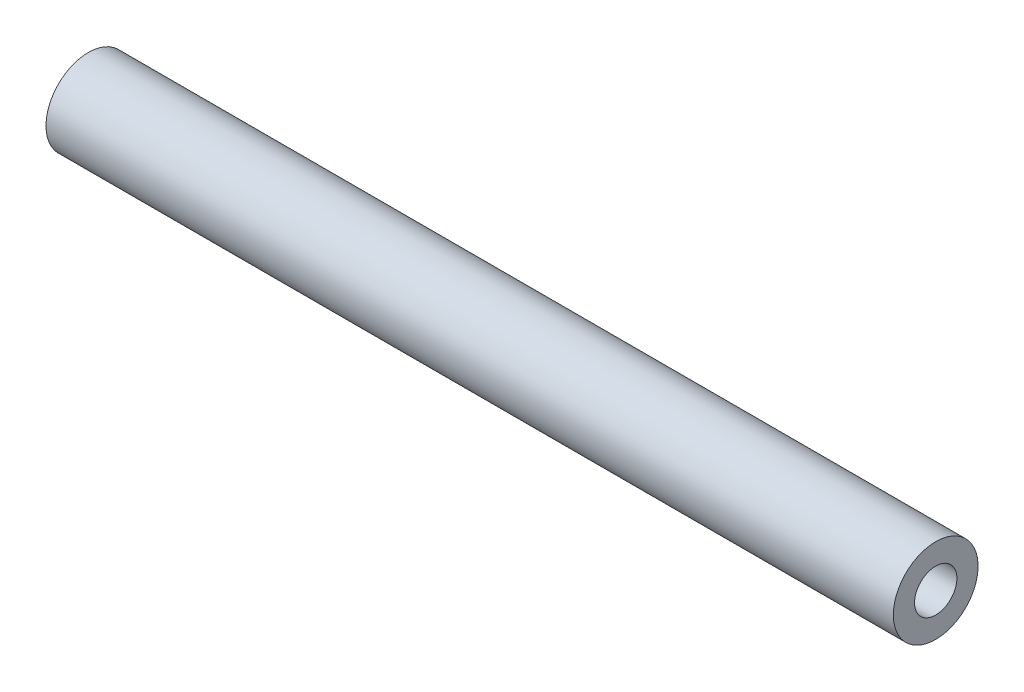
from build123d import *

# Parameters (mm, degrees)
SKIZZE1_W                = 100
SKIZZE1_H                = 5
M6_GEWINDEBOHRUNG1_D     = 5
M6_GEWINDEBOHRUNG1_DEPTH = 17
M6_GEWINDEBOHRUNG1_TIP   = 1.502151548


with BuildPart() as part:
    # Skizze1 → Rotation1 (revolve)
    with BuildSketch(Plane.XY, mode=Mode.PRIVATE) as rotation1_sk:
        with Locations((-50, 2.5)):
            Rectangle(SKIZZE1_W, SKIZZE1_H)
    revolve(rotation1_sk.sketch.rotate(Axis((0, 0, 0), (1, 0, 0)), 90), axis=Axis((0, 0, 0), (1, 0, 0)))

    # M6 Gewindebohrung1
    with Locations(Plane(origin=(0, 0, 0), x_dir=(0, 0, -1), z_dir=(1, 0, 0))):
        with Locations((0, 0)):
            Hole(M6_GEWINDEBOHRUNG1_D / 2, depth=M6_GEWINDEBOHRUNG1_DEPTH)
            with Locations((0, 0, -(M6_GEWINDEBOHRUNG1_DEPTH + M6_GEWINDEBOHRUNG1_TIP / 2))):  # 118° drill point
                Cone(0, M6_GEWINDEBOHRUNG1_D / 2, M6_GEWINDEBOHRUNG1_TIP, mode=Mode.SUBTRACT)


solid = part.part
